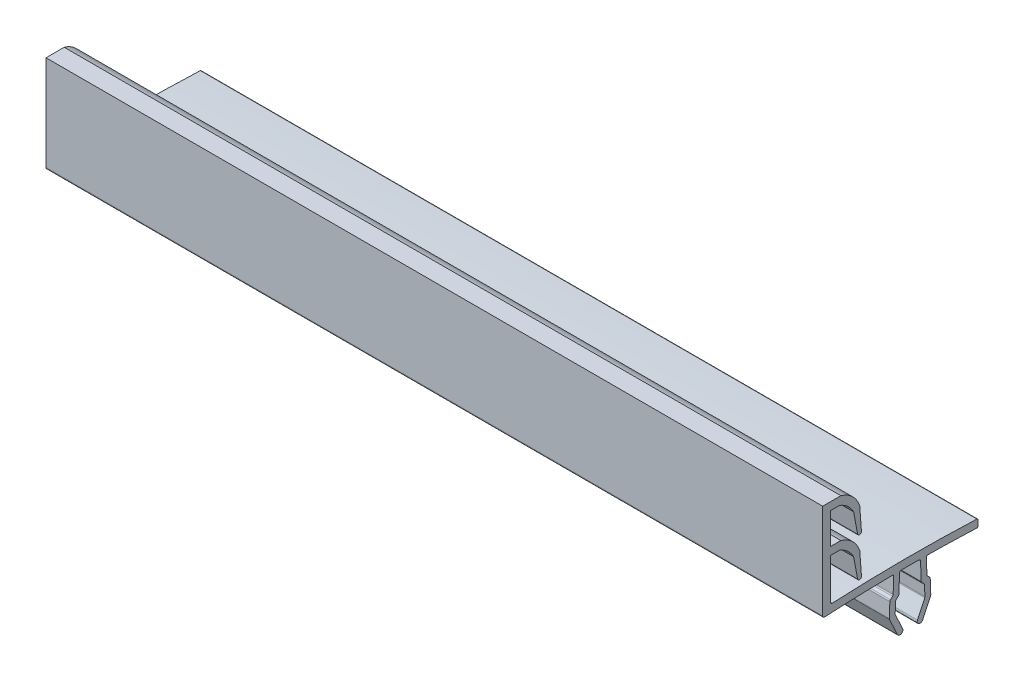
from build123d import *

# Parameters (mm, degrees)
KEHYSTIIVISTEET_1_6041_KEHYSTIIVISTE_1_DEPTH = 200


with BuildPart() as part:
    # Sketch1 → Kehystiivisteet 1.6041 KEHYSTIIVISTE_1 (new body)
    with BuildSketch(Plane(origin=(0, 0, 0), x_dir=(0, 0, -1), z_dir=(1, 0, 0))):
        with BuildLine():
            Line((-9.822006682, 17.373917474), (-14.508298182, 17.373917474))
            Line((-14.508298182, 17.373917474), (-14.508298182, -7.097469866))
            ThreePointArc((-14.508298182, -7.097469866), (-14.352003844, -7.460604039), (-13.980832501, -7.596714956))
            ThreePointArc((-13.980832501, -7.596714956), (-5.248090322, -7.211943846), (3.490974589, -7.018090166))
            ThreePointArc((3.490974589, -7.018090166), (3.709341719, -7.108837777), (3.794129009, -7.329587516))
            Line((3.794129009, -7.329587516), (3.638150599, -11.389820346))
            ThreePointArc((3.638150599, -11.389820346), (3.592773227, -11.57955998), (3.478239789, -11.737491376))
            Line((3.478239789, -11.737491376), (2.952040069, -12.224757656))
            ThreePointArc((2.952040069, -12.224757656), (2.837506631, -12.382689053), (2.792129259, -12.572428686))
            Line((2.792129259, -12.572428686), (2.649959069, -16.273223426))
            ThreePointArc((2.649959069, -16.273223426), (2.659454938, -16.391246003), (2.696436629, -16.503726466))
            Line((2.696436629, -16.503726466), (4.725239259, -20.854507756))
            ThreePointArc((4.725239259, -20.854507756), (5.721933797, -21.217274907), (6.084700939, -20.220580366))
            Line((6.084700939, -20.220580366), (4.209261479, -16.198687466))
            ThreePointArc((4.209261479, -16.198687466), (4.17227979, -16.086207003), (4.162783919, -15.968184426))
            Line((4.162783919, -15.968184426), (4.267172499, -13.250872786))
            ThreePointArc((4.267172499, -13.250872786), (4.312549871, -13.061133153), (4.427083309, -12.903201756))
            Line((4.427083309, -12.903201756), (4.953283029, -12.415935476))
            ThreePointArc((4.953283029, -12.415935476), (5.067816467, -12.25800408), (5.113193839, -12.068264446))
            Line((5.113193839, -12.068264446), (5.289470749, -7.479646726))
            ThreePointArc((5.289470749, -7.479646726), (5.441409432, -7.139522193), (5.786345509, -6.998848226))
            ThreePointArc((5.786345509, -6.998848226), (7.991701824, -6.992768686), (10.197058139, -6.998848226))
            ThreePointArc((10.197058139, -6.998848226), (10.541994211, -7.139522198), (10.693932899, -7.479646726))
            Line((10.693932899, -7.479646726), (10.870209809, -12.068264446))
            ThreePointArc((10.870209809, -12.068264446), (10.915587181, -12.25800408), (11.030120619, -12.415935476))
            Line((11.030120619, -12.415935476), (11.556320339, -12.903201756))
            ThreePointArc((11.556320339, -12.903201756), (11.670853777, -13.061133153), (11.716231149, -13.250872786))
            Line((11.716231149, -13.250872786), (11.820619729, -15.968184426))
            ThreePointArc((11.820619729, -15.968184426), (11.81112386, -16.086207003), (11.774142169, -16.198687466))
            Line((11.774142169, -16.198687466), (9.898702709, -20.220580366))
            ThreePointArc((9.898702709, -20.220580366), (10.261469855, -21.217274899), (11.258164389, -20.854507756))
            Line((11.258164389, -20.854507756), (13.286967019, -16.503726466))
            ThreePointArc((13.286967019, -16.503726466), (13.323948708, -16.391246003), (13.333444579, -16.273223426))
            Line((13.333444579, -16.273223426), (13.191274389, -12.572428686))
            ThreePointArc((13.191274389, -12.572428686), (13.145897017, -12.382689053), (13.031363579, -12.224757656))
            Line((13.031363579, -12.224757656), (12.505163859, -11.737491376))
            ThreePointArc((12.505163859, -11.737491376), (12.390630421, -11.57955998), (12.345253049, -11.389820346))
            Line((12.345253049, -11.389820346), (12.189274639, -7.329587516))
            ThreePointArc((12.189274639, -7.329587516), (12.274061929, -7.108837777), (12.492429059, -7.018090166))
            ThreePointArc((12.492429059, -7.018090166), (18.836985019, -7.139820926), (25.178811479, -7.362185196))
            ThreePointArc((25.178811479, -7.362185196), (25.399226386, -7.279103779), (25.491701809, -7.062462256))
            Line((25.491701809, -7.062462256), (25.491701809, -5.661172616))
            ThreePointArc((25.491701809, -5.661172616), (25.408327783, -5.453631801), (25.204547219, -5.361447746))
            ThreePointArc((25.204547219, -5.361447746), (6.609067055, -4.995146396), (-11.983453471, -5.489352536))
            ThreePointArc((-11.983453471, -5.489352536), (-12.352955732, -5.352201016), (-12.508298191, -4.989970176))
            Line((-12.508298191, -4.989970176), (-12.508298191, 5.373917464))
            Line((-12.508298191, 5.373917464), (-10.136987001, 5.373917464))
            ThreePointArc((-10.136987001, 5.373917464), (-8.043153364, 4.086761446), (-6.543327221, 2.139601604))
            Line((-6.543327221, 2.139601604), (-5.514047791, -3.342365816))
            ThreePointArc((-5.514047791, -3.342365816), (-4.958131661, -3.746066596), (-4.523951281, -3.213615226))
            Line((-4.523951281, -3.213615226), (-4.955038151, 2.655558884))
            ThreePointArc((-4.955038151, 2.655558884), (-6.798947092, 5.622882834), (-9.822006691, 7.373917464))
            Line((-9.822006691, 7.373917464), (-12.508298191, 7.373917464))
            Line((-12.508298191, 7.373917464), (-12.508298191, 15.373917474))
            Line((-12.508298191, 15.373917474), (-10.136986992, 15.373917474))
            ThreePointArc((-10.136986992, 15.373917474), (-8.043153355, 14.086761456), (-6.543327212, 12.139601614))
            Line((-6.543327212, 12.139601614), (-5.514047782, 6.657634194))
            ThreePointArc((-5.514047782, 6.657634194), (-4.958131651, 6.253933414), (-4.523951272, 6.786384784))
            Line((-4.523951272, 6.786384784), (-4.955038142, 12.655558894))
            ThreePointArc((-4.955038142, 12.655558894), (-6.798947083, 15.622882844), (-9.822006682, 17.373917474))
        make_face()
    extrude(amount=KEHYSTIIVISTEET_1_6041_KEHYSTIIVISTE_1_DEPTH)


solid = part.part
